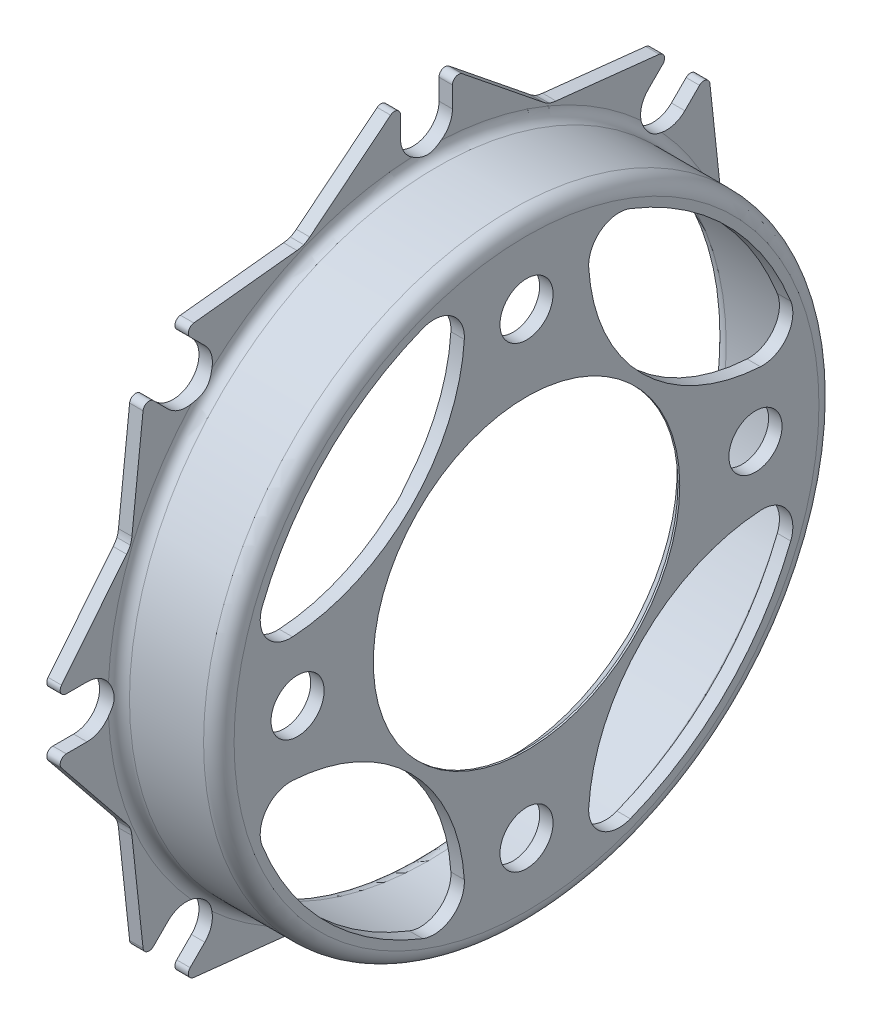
from build123d import *

# Parameters (mm, degrees)
CUT_EXTRUDE1_REACH = 129.92
SKETCH2_R          = 5.5245
CIRPATTERN1_COUNT  = 4
CUT_EXTRUDE2_REACH = 129.92
CIRPATTERN2_COUNT  = 4
CUT_EXTRUDE4_DEPTH = 128.920206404
CIRPATTERN4_COUNT  = 8


with BuildPart() as part:
    # Sketch1 → Revolve1 (revolve)
    with BuildSketch(Plane.XY, mode=Mode.PRIVATE) as revolve1_sk:
        with BuildLine():
            Line((20.81022, 34.127158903), (20.81022, 59.7535))
            ThreePointArc((20.81022, 59.7535), (20.159264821, 61.325044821), (18.58772, 61.976))
            Line((18.58772, 61.976), (3.175, 61.976))
            ThreePointArc((3.175, 61.976), (0.92993597, 62.90593597), (0, 65.151))
            Line((0, 65.151), (0, 88.9))
            Line((0, 88.9), (2.794, 88.9))
            Line((2.794, 88.9), (2.794, 66.2305))
            ThreePointArc((2.794, 66.2305), (3.444955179, 64.658955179), (5.0165, 64.008))
            Line((5.0165, 64.008), (20.42922, 64.008))
            ThreePointArc((20.42922, 64.008), (22.67428403, 63.07806403), (23.60422, 60.833))
            Line((23.60422, 60.833), (23.60422, 31.877))
            Line((23.60422, 31.877), (23.22322, 31.877))
            Line((23.22322, 31.877), (20.81022, 34.127158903))
        make_face()
    revolve(revolve1_sk.sketch.rotate(Axis((24.784431, 0, 0), (-1, 0, 0)), 90), axis=Axis((24.784431, 0, 0), (-1, 0, 0)))

    # Sketch2 → Cut-Extrude1 (cut, up to next)
    with BuildSketch(Plane(origin=(23.60422, 0, 0), x_dir=(0, 0, -1), z_dir=(1, 0, 0)), mode=Mode.PRIVATE) as cut_extrude1_sk1:
        with Locations((0, 47.625)):
            Circle(SKETCH2_R)
    cut_extrude1_tool1 = extrude(cut_extrude1_sk1.sketch, amount=-CUT_EXTRUDE1_REACH, mode=Mode.PRIVATE) & part.part
    cut_extrude1 = cut_extrude1_tool1.solids().sort_by_distance((23.60422, 47.625, 0))[0]
    add(cut_extrude1, mode=Mode.SUBTRACT)

    # CirPattern1: Cut-Extrude1 ×4 about axis
    cirpattern1_axis = Axis((0, 0, 0), (1, 0, 0))
    for i in range(1, CIRPATTERN1_COUNT):
        add(cut_extrude1.rotate(cirpattern1_axis, i * 360 / CIRPATTERN1_COUNT), mode=Mode.SUBTRACT)

    # Sketch3 → Cut-Extrude2 (cut, up to next)
    with BuildSketch(Plane(origin=(23.60422, 0, 0), x_dir=(0, 0, -1), z_dir=(1, 0, 0)), mode=Mode.PRIVATE) as cut_extrude2_sk1:
        with BuildLine():
            ThreePointArc((54.961942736, 21.60272843), (41.758190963, 41.758190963), (21.60272843, 54.961942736))
            ThreePointArc((21.60272843, 54.961942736), (15.547007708, 54.189016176), (12.941472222, 48.66811464))
            ThreePointArc((12.941472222, 48.66811464), (24.030996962, 24.030996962), (48.66811464, 12.941472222))
            ThreePointArc((48.66811464, 12.941472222), (54.189016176, 15.547007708), (54.961942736, 21.60272843))
        make_face()
    cut_extrude2_tool1 = extrude(cut_extrude2_sk1.sketch, amount=-CUT_EXTRUDE2_REACH, mode=Mode.PRIVATE) & part.part
    cut_extrude2 = cut_extrude2_tool1.solids().sort_by_distance((23.60422, 33.241486, -33.241486))[0]
    add(cut_extrude2, mode=Mode.SUBTRACT)

    # CirPattern2: Cut-Extrude2 ×4 about axis
    cirpattern2_axis = Axis((0, 0, 0), (1, 0, 0))
    for i in range(1, CIRPATTERN2_COUNT):
        add(cut_extrude2.rotate(cirpattern2_axis, i * 360 / CIRPATTERN2_COUNT), mode=Mode.SUBTRACT)

    # Sketch5 → Cut-Extrude4 (cut, through all)
    with BuildSketch(Plane.ZY):
        with BuildLine():
            Line((-7.463999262, 75.919185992), (-24.280161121, 62.378698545))
            ThreePointArc((-24.280161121, 62.378698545), (-24.875319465, 61.953553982), (-25.515417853, 61.59966783))
            Line((-25.515417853, 61.59966783), (-34.020557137, 82.13289044))
            ThreePointArc((-34.020557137, 82.13289044), (0, 88.9), (34.020557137, 82.13289044))
            Line((34.020557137, 82.13289044), (25.515417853, 61.59966783))
            ThreePointArc((25.515417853, 61.59966783), (24.875319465, 61.953553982), (24.280161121, 62.378698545))
            Line((24.280161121, 62.378698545), (7.463999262, 75.919185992))
            ThreePointArc((7.463999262, 75.919185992), (6.119163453, 76.075524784), (5.3975, 74.93))
            Line((5.3975, 74.93), (5.3975, 70.612))
            ThreePointArc((5.3975, 70.612), (0, 65.2145), (-5.3975, 70.612))
            Line((-5.3975, 70.612), (-5.3975, 74.93))
            ThreePointArc((-5.3975, 74.93), (-6.119163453, 76.075524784), (-7.463999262, 75.919185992))
        make_face()
    cut_extrude4 = extrude(amount=-CUT_EXTRUDE4_DEPTH, mode=Mode.SUBTRACT)

    # CirPattern4: Cut-Extrude4 ×8 about axis
    cirpattern4_axis = Axis((0, 0, 0), (1, 0, 0))
    for i in range(1, CIRPATTERN4_COUNT):
        add(cut_extrude4.rotate(cirpattern4_axis, i * 360 / CIRPATTERN4_COUNT), mode=Mode.SUBTRACT)


solid = part.part
